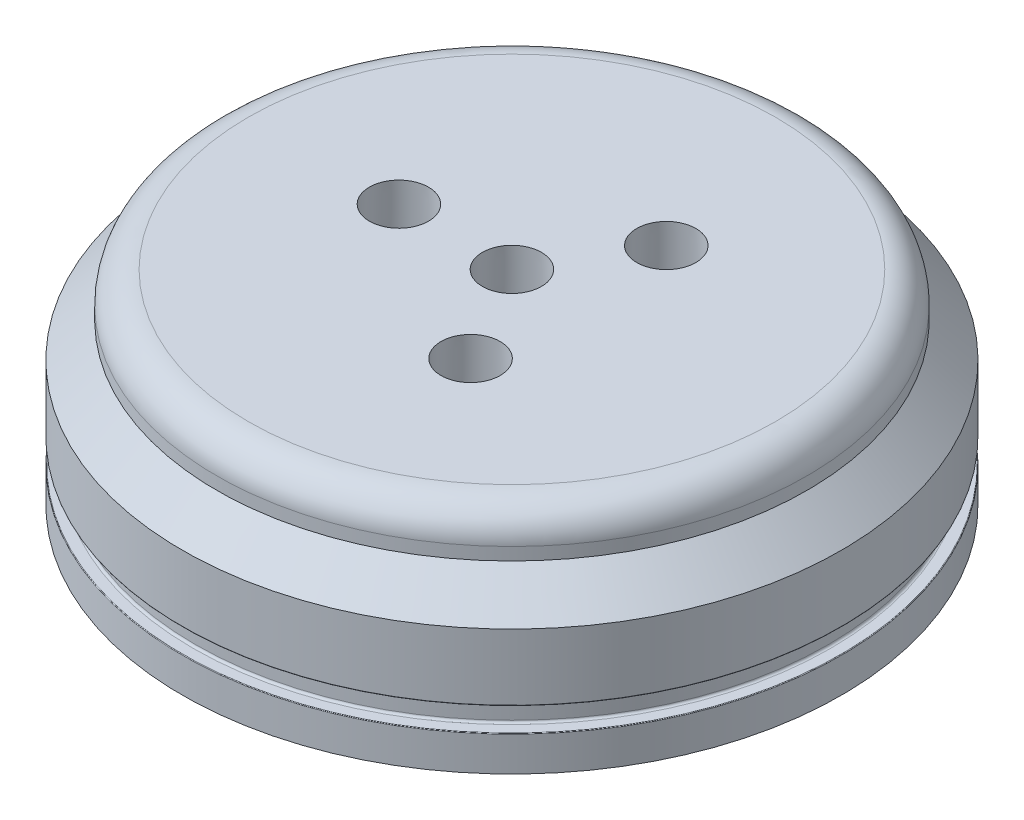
ISO-10303-21;
HEADER;
FILE_DESCRIPTION(('STEP AP214'),'2;1');
FILE_NAME('part.step','',(''),(''),'','','');
FILE_SCHEMA(('AUTOMOTIVE_DESIGN { 1 0 10303 214 1 1 1 1 }'));
ENDSEC;
DATA;
#1=APPLICATION_CONTEXT('core data for automotive mechanical design processes');
#2=APPLICATION_PROTOCOL_DEFINITION('international standard','automotive_design',2000,#1);
#3=PRODUCT_CONTEXT('',#1,'mechanical');
#4=PRODUCT('Part','Part','',(#3));
#5=PRODUCT_RELATED_PRODUCT_CATEGORY('part','',(#4));
#6=PRODUCT_DEFINITION_FORMATION('','',#4);
#7=PRODUCT_DEFINITION_CONTEXT('part definition',#1,'design');
#8=PRODUCT_DEFINITION('design','',#6,#7);
#9=PRODUCT_DEFINITION_SHAPE('','',#8);
#10=(LENGTH_UNIT() NAMED_UNIT(*) SI_UNIT(.MILLI.,.METRE.));
#11=(NAMED_UNIT(*) PLANE_ANGLE_UNIT() SI_UNIT($,.RADIAN.));
#12=(NAMED_UNIT(*) SI_UNIT($,.STERADIAN.) SOLID_ANGLE_UNIT());
#13=UNCERTAINTY_MEASURE_WITH_UNIT(LENGTH_MEASURE(1.E-05),#10,'distance_accuracy_value','');
#14=(GEOMETRIC_REPRESENTATION_CONTEXT(3) GLOBAL_UNCERTAINTY_ASSIGNED_CONTEXT((#13)) GLOBAL_UNIT_ASSIGNED_CONTEXT((#10,
#11,#12)) REPRESENTATION_CONTEXT('',''));
#15=CARTESIAN_POINT('',(0.,0.,0.));
#16=DIRECTION('',(0.,0.,1.));
#17=DIRECTION('',(1.,0.,0.));
#18=AXIS2_PLACEMENT_3D('',#15,#16,#17);
#19=CARTESIAN_POINT('',(-59.69,41.275,0.));
#20=DIRECTION('',(0.,-1.,0.));
#21=DIRECTION('',(0.,0.,-1.));
#22=AXIS2_PLACEMENT_3D('',#19,#20,#21);
#23=PLANE('',#22);
#24=CARTESIAN_POINT('',(0.,41.275,0.));
#25=DIRECTION('',(0.,-1.,0.));
#26=DIRECTION('',(0.,0.,-1.));
#27=AXIS2_PLACEMENT_3D('',#24,#25,#26);
#28=CIRCLE('',#27,5.97790349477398);
#29=CARTESIAN_POINT('',(0.,41.275,-5.97790349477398));
#30=VERTEX_POINT('',#29);
#31=EDGE_CURVE('E94',#30,#30,#28,.T.);
#32=ORIENTED_EDGE('',*,*,#31,.T.);
#33=EDGE_LOOP('',(#32));
#34=FACE_BOUND('',#33,.T.);
#35=CARTESIAN_POINT('',(0.,41.275,0.));
#36=DIRECTION('',(0.,-1.,0.));
#37=DIRECTION('',(0.,0.,-1.));
#38=AXIS2_PLACEMENT_3D('',#35,#36,#37);
#39=CIRCLE('',#38,53.34);
#40=CARTESIAN_POINT('',(0.,41.275,-53.34));
#41=VERTEX_POINT('',#40);
#42=EDGE_CURVE('E11',#41,#41,#39,.F.);
#43=ORIENTED_EDGE('',*,*,#42,.T.);
#44=EDGE_LOOP('',(#43));
#45=FACE_BOUND('',#44,.T.);
#46=CARTESIAN_POINT('',(11.4299999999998,41.275,19.7973407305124));
#47=DIRECTION('',(0.,-1.,0.));
#48=DIRECTION('',(0.,0.,-1.));
#49=AXIS2_PLACEMENT_3D('',#46,#47,#48);
#50=CIRCLE('',#49,5.97790349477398);
#51=CARTESIAN_POINT('',(11.4299999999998,41.275,13.8194372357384));
#52=VERTEX_POINT('',#51);
#53=EDGE_CURVE('E151',#52,#52,#50,.T.);
#54=ORIENTED_EDGE('',*,*,#53,.T.);
#55=EDGE_LOOP('',(#54));
#56=FACE_BOUND('',#55,.T.);
#57=CARTESIAN_POINT('',(11.4300000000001,41.275,-19.7973407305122));
#58=DIRECTION('',(0.,-1.,0.));
#59=DIRECTION('',(0.,0.,-1.));
#60=AXIS2_PLACEMENT_3D('',#57,#58,#59);
#61=CIRCLE('',#60,5.97790349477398);
#62=CARTESIAN_POINT('',(11.4300000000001,41.275,-25.7752442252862));
#63=VERTEX_POINT('',#62);
#64=EDGE_CURVE('E155',#63,#63,#61,.T.);
#65=ORIENTED_EDGE('',*,*,#64,.T.);
#66=EDGE_LOOP('',(#65));
#67=FACE_BOUND('',#66,.T.);
#68=CARTESIAN_POINT('',(-22.86,41.275,0.));
#69=DIRECTION('',(0.,-1.,0.));
#70=DIRECTION('',(0.,0.,-1.));
#71=AXIS2_PLACEMENT_3D('',#68,#69,#70);
#72=CIRCLE('',#71,5.97790349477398);
#73=CARTESIAN_POINT('',(-22.86,41.275,-5.97790349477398));
#74=VERTEX_POINT('',#73);
#75=EDGE_CURVE('E159',#74,#74,#72,.T.);
#76=ORIENTED_EDGE('',*,*,#75,.T.);
#77=EDGE_LOOP('',(#76));
#78=FACE_BOUND('',#77,.T.);
#79=ADVANCED_FACE('F38',(#34,#45,#56,#67,#78),#23,.F.);
#80=CARTESIAN_POINT('',(-50.8,0.,0.));
#81=DIRECTION('',(0.,1.,0.));
#82=DIRECTION('',(0.,0.,1.));
#83=AXIS2_PLACEMENT_3D('',#80,#81,#82);
#84=PLANE('',#83);
#85=CARTESIAN_POINT('',(-26.9694561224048,0.,52.1799036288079));
#86=DIRECTION('',(0.,-1.,0.));
#87=DIRECTION('',(0.,0.,-1.));
#88=AXIS2_PLACEMENT_3D('',#85,#86,#87);
#89=CIRCLE('',#88,1.72719999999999);
#90=CARTESIAN_POINT('',(-26.9694561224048,0.,50.4527036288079));
#91=VERTEX_POINT('',#90);
#92=EDGE_CURVE('E88',#91,#91,#89,.T.);
#93=ORIENTED_EDGE('',*,*,#92,.F.);
#94=EDGE_LOOP('',(#93));
#95=FACE_BOUND('',#94,.T.);
#96=CARTESIAN_POINT('',(-8.85182948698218,0.,58.0666773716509));
#97=DIRECTION('',(0.,-1.,0.));
#98=DIRECTION('',(0.,0.,-1.));
#99=AXIS2_PLACEMENT_3D('',#96,#97,#98);
#100=CIRCLE('',#99,1.72719999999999);
#101=CARTESIAN_POINT('',(-8.85182948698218,0.,56.3394773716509));
#102=VERTEX_POINT('',#101);
#103=EDGE_CURVE('E87',#102,#102,#100,.T.);
#104=ORIENTED_EDGE('',*,*,#103,.F.);
#105=EDGE_LOOP('',(#104));
#106=FACE_BOUND('',#105,.T.);
#107=CARTESIAN_POINT('',(41.2920170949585,0.,41.7739539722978));
#108=DIRECTION('',(0.,-1.,0.));
#109=DIRECTION('',(0.,0.,-1.));
#110=AXIS2_PLACEMENT_3D('',#107,#108,#109);
#111=CIRCLE('',#110,1.72719999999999);
#112=CARTESIAN_POINT('',(41.2920170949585,0.,40.0467539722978));
#113=VERTEX_POINT('',#112);
#114=EDGE_CURVE('E100',#113,#113,#111,.T.);
#115=ORIENTED_EDGE('',*,*,#114,.F.);
#116=EDGE_LOOP('',(#115));
#117=FACE_BOUND('',#116,.T.);
#118=CARTESIAN_POINT('',(52.4893261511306,0.,-26.3621802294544));
#119=DIRECTION('',(0.,-1.,0.));
#120=DIRECTION('',(0.,0.,-1.));
#121=AXIS2_PLACEMENT_3D('',#118,#119,#120);
#122=CIRCLE('',#121,1.72719999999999);
#123=CARTESIAN_POINT('',(52.4893261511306,0.,-28.0893802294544));
#124=VERTEX_POINT('',#123);
#125=EDGE_CURVE('E112',#124,#124,#122,.T.);
#126=ORIENTED_EDGE('',*,*,#125,.F.);
#127=EDGE_LOOP('',(#126));
#128=FACE_BOUND('',#127,.T.);
#129=CARTESIAN_POINT('',(41.2920170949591,0.,-41.7739539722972));
#130=DIRECTION('',(0.,-1.,0.));
#131=DIRECTION('',(0.,0.,-1.));
#132=AXIS2_PLACEMENT_3D('',#129,#130,#131);
#133=CIRCLE('',#132,1.72719999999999);
#134=CARTESIAN_POINT('',(41.2920170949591,0.,-43.5011539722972));
#135=VERTEX_POINT('',#134);
#136=EDGE_CURVE('E118',#135,#135,#133,.T.);
#137=ORIENTED_EDGE('',*,*,#136,.F.);
#138=EDGE_LOOP('',(#137));
#139=FACE_BOUND('',#138,.T.);
#140=CARTESIAN_POINT('',(-8.85182948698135,0.,-58.066677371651));
#141=DIRECTION('',(0.,-1.,0.));
#142=DIRECTION('',(0.,0.,-1.));
#143=AXIS2_PLACEMENT_3D('',#140,#141,#142);
#144=CIRCLE('',#143,1.72719999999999);
#145=CARTESIAN_POINT('',(-8.85182948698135,0.,-59.793877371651));
#146=VERTEX_POINT('',#145);
#147=EDGE_CURVE('E124',#146,#146,#144,.T.);
#148=ORIENTED_EDGE('',*,*,#147,.F.);
#149=EDGE_LOOP('',(#148));
#150=FACE_BOUND('',#149,.T.);
#151=CARTESIAN_POINT('',(-26.9694561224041,0.,-52.1799036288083));
#152=DIRECTION('',(0.,-1.,0.));
#153=DIRECTION('',(0.,0.,-1.));
#154=AXIS2_PLACEMENT_3D('',#151,#152,#153);
#155=CIRCLE('',#154,1.72719999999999);
#156=CARTESIAN_POINT('',(-26.9694561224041,0.,-53.9071036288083));
#157=VERTEX_POINT('',#156);
#158=EDGE_CURVE('E130',#157,#157,#155,.T.);
#159=ORIENTED_EDGE('',*,*,#158,.F.);
#160=EDGE_LOOP('',(#159));
#161=FACE_BOUND('',#160,.T.);
#162=CARTESIAN_POINT('',(-57.9600576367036,0.,-9.525));
#163=DIRECTION('',(0.,-1.,0.));
#164=DIRECTION('',(0.,0.,-1.));
#165=AXIS2_PLACEMENT_3D('',#162,#163,#164);
#166=CIRCLE('',#165,1.72719999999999);
#167=CARTESIAN_POINT('',(-57.9600576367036,0.,-11.2522));
#168=VERTEX_POINT('',#167);
#169=EDGE_CURVE('E136',#168,#168,#166,.T.);
#170=ORIENTED_EDGE('',*,*,#169,.F.);
#171=EDGE_LOOP('',(#170));
#172=FACE_BOUND('',#171,.T.);
#173=CARTESIAN_POINT('',(-57.9600576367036,0.,9.525));
#174=DIRECTION('',(0.,-1.,0.));
#175=DIRECTION('',(0.,0.,-1.));
#176=AXIS2_PLACEMENT_3D('',#173,#174,#175);
#177=CIRCLE('',#176,1.72719999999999);
#178=CARTESIAN_POINT('',(-57.9600576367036,0.,7.79780000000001));
#179=VERTEX_POINT('',#178);
#180=EDGE_CURVE('E142',#179,#179,#177,.T.);
#181=ORIENTED_EDGE('',*,*,#180,.F.);
#182=EDGE_LOOP('',(#181));
#183=FACE_BOUND('',#182,.T.);
#184=CARTESIAN_POINT('',(0.,0.,0.));
#185=DIRECTION('',(0.,-1.,0.));
#186=DIRECTION('',(0.,0.,-1.));
#187=AXIS2_PLACEMENT_3D('',#184,#185,#186);
#188=CIRCLE('',#187,50.8);
#189=CARTESIAN_POINT('',(0.,0.,-50.8));
#190=VERTEX_POINT('',#189);
#191=EDGE_CURVE('E172',#190,#190,#188,.T.);
#192=ORIENTED_EDGE('',*,*,#191,.F.);
#193=EDGE_LOOP('',(#192));
#194=FACE_BOUND('',#193,.T.);
#195=CARTESIAN_POINT('',(0.,0.,0.));
#196=DIRECTION('',(0.,-1.,0.));
#197=DIRECTION('',(0.,0.,-1.));
#198=AXIS2_PLACEMENT_3D('',#195,#196,#197);
#199=CIRCLE('',#198,66.675);
#200=CARTESIAN_POINT('',(0.,0.,-66.675));
#201=VERTEX_POINT('',#200);
#202=EDGE_CURVE('E169',#201,#201,#199,.T.);
#203=ORIENTED_EDGE('',*,*,#202,.T.);
#204=EDGE_LOOP('',(#203));
#205=FACE_BOUND('',#204,.T.);
#206=CARTESIAN_POINT('',(52.4893261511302,0.,26.3621802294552));
#207=DIRECTION('',(0.,-1.,0.));
#208=DIRECTION('',(0.,0.,-1.));
#209=AXIS2_PLACEMENT_3D('',#206,#207,#208);
#210=CIRCLE('',#209,1.72719999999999);
#211=CARTESIAN_POINT('',(52.4893261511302,0.,24.6349802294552));
#212=VERTEX_POINT('',#211);
#213=EDGE_CURVE('E106',#212,#212,#210,.T.);
#214=ORIENTED_EDGE('',*,*,#213,.F.);
#215=EDGE_LOOP('',(#214));
#216=FACE_BOUND('',#215,.T.);
#217=ADVANCED_FACE('F228',(#95,#106,#117,#128,#139,#150,#161,#172,#183,#194,#205,#216),#84,.F.);
#218=CARTESIAN_POINT('',(0.,7.5565,0.));
#219=DIRECTION('',(0.,-1.,0.));
#220=DIRECTION('',(0.,0.,-1.));
#221=AXIS2_PLACEMENT_3D('',#218,#219,#220);
#222=TOROIDAL_SURFACE('',#221,64.4779,0.4445);
#223=CARTESIAN_POINT('',(0.,7.112,0.));
#224=DIRECTION('',(0.,-1.,0.));
#225=DIRECTION('',(0.,0.,-1.));
#226=AXIS2_PLACEMENT_3D('',#223,#224,#225);
#227=CIRCLE('',#226,64.4779);
#228=CARTESIAN_POINT('',(0.,7.112,-64.4779));
#229=VERTEX_POINT('',#228);
#230=EDGE_CURVE('E160',#229,#229,#227,.T.);
#231=ORIENTED_EDGE('',*,*,#230,.F.);
#232=EDGE_LOOP('',(#231));
#233=FACE_BOUND('',#232,.T.);
#234=CARTESIAN_POINT('',(0.,7.5565,0.));
#235=DIRECTION('',(0.,-1.,0.));
#236=DIRECTION('',(0.,0.,-1.));
#237=AXIS2_PLACEMENT_3D('',#234,#235,#236);
#238=CIRCLE('',#237,64.0334);
#239=CARTESIAN_POINT('',(0.,7.5565,-64.0334));
#240=VERTEX_POINT('',#239);
#241=EDGE_CURVE('E199',#240,#240,#238,.T.);
#242=ORIENTED_EDGE('',*,*,#241,.T.);
#243=EDGE_LOOP('',(#242));
#244=FACE_BOUND('',#243,.T.);
#245=ADVANCED_FACE('F234',(#233,#244),#222,.F.);
#246=CARTESIAN_POINT('',(0.,0.,0.));
#247=DIRECTION('',(0.,-1.,0.));
#248=DIRECTION('',(0.,0.,-1.));
#249=AXIS2_PLACEMENT_3D('',#246,#247,#248);
#250=CYLINDRICAL_SURFACE('',#249,64.0334);
#251=ORIENTED_EDGE('',*,*,#241,.F.);
#252=EDGE_LOOP('',(#251));
#253=FACE_BOUND('',#252,.T.);
#254=CARTESIAN_POINT('',(0.,11.4935,0.));
#255=DIRECTION('',(0.,-1.,0.));
#256=DIRECTION('',(0.,0.,-1.));
#257=AXIS2_PLACEMENT_3D('',#254,#255,#256);
#258=CIRCLE('',#257,64.0334);
#259=CARTESIAN_POINT('',(0.,11.4935,-64.0334));
#260=VERTEX_POINT('',#259);
#261=EDGE_CURVE('E196',#260,#260,#258,.T.);
#262=ORIENTED_EDGE('',*,*,#261,.T.);
#263=EDGE_LOOP('',(#262));
#264=FACE_BOUND('',#263,.T.);
#265=ADVANCED_FACE('F264',(#253,#264),#250,.T.);
#266=CARTESIAN_POINT('',(0.,11.4935,0.));
#267=DIRECTION('',(0.,-1.,0.));
#268=DIRECTION('',(0.,0.,-1.));
#269=AXIS2_PLACEMENT_3D('',#266,#267,#268);
#270=TOROIDAL_SURFACE('',#269,64.4779,0.4445);
#271=ORIENTED_EDGE('',*,*,#261,.F.);
#272=EDGE_LOOP('',(#271));
#273=FACE_BOUND('',#272,.T.);
#274=CARTESIAN_POINT('',(0.,11.938,0.));
#275=DIRECTION('',(0.,-1.,0.));
#276=DIRECTION('',(0.,0.,-1.));
#277=AXIS2_PLACEMENT_3D('',#274,#275,#276);
#278=CIRCLE('',#277,64.4779);
#279=CARTESIAN_POINT('',(0.,11.938,-64.4779));
#280=VERTEX_POINT('',#279);
#281=EDGE_CURVE('E193',#280,#280,#278,.T.);
#282=ORIENTED_EDGE('',*,*,#281,.T.);
#283=EDGE_LOOP('',(#282));
#284=FACE_BOUND('',#283,.T.);
#285=ADVANCED_FACE('F260',(#273,#284),#270,.F.);
#286=CARTESIAN_POINT('',(-66.548,11.938,0.));
#287=DIRECTION('',(0.,1.,0.));
#288=DIRECTION('',(0.,0.,1.));
#289=AXIS2_PLACEMENT_3D('',#286,#287,#288);
#290=PLANE('',#289);
#291=ORIENTED_EDGE('',*,*,#281,.F.);
#292=EDGE_LOOP('',(#291));
#293=FACE_BOUND('',#292,.T.);
#294=CARTESIAN_POINT('',(0.,11.938,0.));
#295=DIRECTION('',(0.,-1.,0.));
#296=DIRECTION('',(0.,0.,-1.));
#297=AXIS2_PLACEMENT_3D('',#294,#295,#296);
#298=CIRCLE('',#297,66.548);
#299=CARTESIAN_POINT('',(0.,11.938,-66.548));
#300=VERTEX_POINT('',#299);
#301=EDGE_CURVE('E190',#300,#300,#298,.T.);
#302=ORIENTED_EDGE('',*,*,#301,.T.);
#303=EDGE_LOOP('',(#302));
#304=FACE_BOUND('',#303,.T.);
#305=ADVANCED_FACE('F256',(#293,#304),#290,.F.);
#306=CARTESIAN_POINT('',(0.,12.065,0.));
#307=DIRECTION('',(0.,-1.,0.));
#308=DIRECTION('',(0.,0.,-1.));
#309=AXIS2_PLACEMENT_3D('',#306,#307,#308);
#310=TOROIDAL_SURFACE('',#309,66.548,0.127000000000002);
#311=ORIENTED_EDGE('',*,*,#301,.F.);
#312=EDGE_LOOP('',(#311));
#313=FACE_BOUND('',#312,.T.);
#314=CARTESIAN_POINT('',(0.,12.065,0.));
#315=DIRECTION('',(0.,-1.,0.));
#316=DIRECTION('',(0.,0.,-1.));
#317=AXIS2_PLACEMENT_3D('',#314,#315,#316);
#318=CIRCLE('',#317,66.675);
#319=CARTESIAN_POINT('',(0.,12.065,-66.675));
#320=VERTEX_POINT('',#319);
#321=EDGE_CURVE('E187',#320,#320,#318,.T.);
#322=ORIENTED_EDGE('',*,*,#321,.T.);
#323=EDGE_LOOP('',(#322));
#324=FACE_BOUND('',#323,.T.);
#325=ADVANCED_FACE('F252',(#313,#324),#310,.T.);
#326=CARTESIAN_POINT('',(0.,0.,0.));
#327=DIRECTION('',(0.,-1.,0.));
#328=DIRECTION('',(0.,0.,-1.));
#329=AXIS2_PLACEMENT_3D('',#326,#327,#328);
#330=CYLINDRICAL_SURFACE('',#329,66.675);
#331=ORIENTED_EDGE('',*,*,#321,.F.);
#332=EDGE_LOOP('',(#331));
#333=FACE_BOUND('',#332,.T.);
#334=CARTESIAN_POINT('',(0.,25.4,0.));
#335=DIRECTION('',(0.,-1.,0.));
#336=DIRECTION('',(0.,0.,-1.));
#337=AXIS2_PLACEMENT_3D('',#334,#335,#336);
#338=CIRCLE('',#337,66.675);
#339=CARTESIAN_POINT('',(0.,25.4,-66.675));
#340=VERTEX_POINT('',#339);
#341=EDGE_CURVE('E184',#340,#340,#338,.T.);
#342=ORIENTED_EDGE('',*,*,#341,.T.);
#343=EDGE_LOOP('',(#342));
#344=FACE_BOUND('',#343,.T.);
#345=ADVANCED_FACE('F248',(#333,#344),#330,.T.);
#346=CARTESIAN_POINT('',(0.,32.385,0.));
#347=DIRECTION('',(0.,-1.,0.));
#348=DIRECTION('',(0.,0.,-1.));
#349=AXIS2_PLACEMENT_3D('',#346,#347,#348);
#350=CONICAL_SURFACE('',#349,59.69,0.78539816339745);
#351=ORIENTED_EDGE('',*,*,#341,.F.);
#352=EDGE_LOOP('',(#351));
#353=FACE_BOUND('',#352,.T.);
#354=CARTESIAN_POINT('',(0.,32.385,0.));
#355=DIRECTION('',(0.,-1.,0.));
#356=DIRECTION('',(0.,0.,-1.));
#357=AXIS2_PLACEMENT_3D('',#354,#355,#356);
#358=CIRCLE('',#357,59.69);
#359=CARTESIAN_POINT('',(0.,32.385,-59.69));
#360=VERTEX_POINT('',#359);
#361=EDGE_CURVE('E181',#360,#360,#358,.T.);
#362=ORIENTED_EDGE('',*,*,#361,.T.);
#363=EDGE_LOOP('',(#362));
#364=FACE_BOUND('',#363,.T.);
#365=ADVANCED_FACE('F245',(#353,#364),#350,.T.);
#366=CARTESIAN_POINT('',(0.,0.,0.));
#367=DIRECTION('',(0.,-1.,0.));
#368=DIRECTION('',(0.,0.,-1.));
#369=AXIS2_PLACEMENT_3D('',#366,#367,#368);
#370=CYLINDRICAL_SURFACE('',#369,59.69);
#371=CARTESIAN_POINT('',(0.,34.925,0.));
#372=DIRECTION('',(0.,-1.,0.));
#373=DIRECTION('',(0.,0.,-1.));
#374=AXIS2_PLACEMENT_3D('',#371,#372,#373);
#375=CIRCLE('',#374,59.69);
#376=CARTESIAN_POINT('',(0.,34.925,-59.69));
#377=VERTEX_POINT('',#376);
#378=EDGE_CURVE('E46',#377,#377,#375,.T.);
#379=ORIENTED_EDGE('',*,*,#378,.T.);
#380=EDGE_LOOP('',(#379));
#381=FACE_BOUND('',#380,.T.);
#382=ORIENTED_EDGE('',*,*,#361,.F.);
#383=EDGE_LOOP('',(#382));
#384=FACE_BOUND('',#383,.T.);
#385=ADVANCED_FACE('F210',(#381,#384),#370,.T.);
#386=CARTESIAN_POINT('',(-42.2531067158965,32.385,0.));
#387=DIRECTION('',(0.,1.,0.));
#388=DIRECTION('',(0.,0.,1.));
#389=AXIS2_PLACEMENT_3D('',#386,#387,#388);
#390=PLANE('',#389);
#391=CARTESIAN_POINT('',(0.,32.385,0.));
#392=DIRECTION('',(0.,-1.,0.));
#393=DIRECTION('',(0.,0.,-1.));
#394=AXIS2_PLACEMENT_3D('',#391,#392,#393);
#395=CIRCLE('',#394,6.244082);
#396=CARTESIAN_POINT('',(0.,32.385,-6.244082));
#397=VERTEX_POINT('',#396);
#398=EDGE_CURVE('E728',#397,#397,#395,.T.);
#399=ORIENTED_EDGE('',*,*,#398,.F.);
#400=EDGE_LOOP('',(#399));
#401=FACE_BOUND('',#400,.T.);
#402=CARTESIAN_POINT('',(11.4299999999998,32.385,19.7973407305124));
#403=DIRECTION('',(0.,-1.,0.));
#404=DIRECTION('',(0.,0.,-1.));
#405=AXIS2_PLACEMENT_3D('',#402,#403,#404);
#406=CIRCLE('',#405,6.244082);
#407=CARTESIAN_POINT('',(11.4299999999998,32.385,13.5532587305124));
#408=VERTEX_POINT('',#407);
#409=EDGE_CURVE('E148',#408,#408,#406,.T.);
#410=ORIENTED_EDGE('',*,*,#409,.F.);
#411=EDGE_LOOP('',(#410));
#412=FACE_BOUND('',#411,.T.);
#413=CARTESIAN_POINT('',(11.4300000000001,32.385,-19.7973407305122));
#414=DIRECTION('',(0.,-1.,0.));
#415=DIRECTION('',(0.,0.,-1.));
#416=AXIS2_PLACEMENT_3D('',#413,#414,#415);
#417=CIRCLE('',#416,6.244082);
#418=CARTESIAN_POINT('',(11.4300000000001,32.385,-26.0414227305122));
#419=VERTEX_POINT('',#418);
#420=EDGE_CURVE('E152',#419,#419,#417,.T.);
#421=ORIENTED_EDGE('',*,*,#420,.F.);
#422=EDGE_LOOP('',(#421));
#423=FACE_BOUND('',#422,.T.);
#424=CARTESIAN_POINT('',(-22.86,32.385,0.));
#425=DIRECTION('',(0.,-1.,0.));
#426=DIRECTION('',(0.,0.,-1.));
#427=AXIS2_PLACEMENT_3D('',#424,#425,#426);
#428=CIRCLE('',#427,6.244082);
#429=CARTESIAN_POINT('',(-22.86,32.385,-6.244082));
#430=VERTEX_POINT('',#429);
#431=EDGE_CURVE('E156',#430,#430,#428,.T.);
#432=ORIENTED_EDGE('',*,*,#431,.F.);
#433=EDGE_LOOP('',(#432));
#434=FACE_BOUND('',#433,.T.);
#435=CARTESIAN_POINT('',(0.,32.385,0.));
#436=DIRECTION('',(0.,-1.,0.));
#437=DIRECTION('',(0.,0.,-1.));
#438=AXIS2_PLACEMENT_3D('',#435,#436,#437);
#439=CIRCLE('',#438,42.2531067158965);
#440=CARTESIAN_POINT('',(0.,32.385,-42.2531067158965));
#441=VERTEX_POINT('',#440);
#442=EDGE_CURVE('E178',#441,#441,#439,.T.);
#443=ORIENTED_EDGE('',*,*,#442,.T.);
#444=EDGE_LOOP('',(#443));
#445=FACE_BOUND('',#444,.T.);
#446=ADVANCED_FACE('F241',(#401,#412,#423,#434,#445),#390,.F.);
#447=CARTESIAN_POINT('',(0.,23.8381067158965,0.));
#448=DIRECTION('',(0.,-1.,0.));
#449=DIRECTION('',(0.,0.,-1.));
#450=AXIS2_PLACEMENT_3D('',#447,#448,#449);
#451=TOROIDAL_SURFACE('',#450,42.2531067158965,8.54689328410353);
#452=ORIENTED_EDGE('',*,*,#442,.F.);
#453=EDGE_LOOP('',(#452));
#454=FACE_BOUND('',#453,.T.);
#455=CARTESIAN_POINT('',(0.,23.8381067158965,0.));
#456=DIRECTION('',(0.,-1.,0.));
#457=DIRECTION('',(0.,0.,-1.));
#458=AXIS2_PLACEMENT_3D('',#455,#456,#457);
#459=CIRCLE('',#458,50.8);
#460=CARTESIAN_POINT('',(0.,23.8381067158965,-50.8));
#461=VERTEX_POINT('',#460);
#462=EDGE_CURVE('E175',#461,#461,#459,.T.);
#463=ORIENTED_EDGE('',*,*,#462,.T.);
#464=EDGE_LOOP('',(#463));
#465=FACE_BOUND('',#464,.T.);
#466=ADVANCED_FACE('F311',(#454,#465),#451,.F.);
#467=CARTESIAN_POINT('',(0.,0.,0.));
#468=DIRECTION('',(0.,-1.,0.));
#469=DIRECTION('',(0.,0.,-1.));
#470=AXIS2_PLACEMENT_3D('',#467,#468,#469);
#471=CYLINDRICAL_SURFACE('',#470,50.8);
#472=ORIENTED_EDGE('',*,*,#462,.F.);
#473=EDGE_LOOP('',(#472));
#474=FACE_BOUND('',#473,.T.);
#475=ORIENTED_EDGE('',*,*,#191,.T.);
#476=EDGE_LOOP('',(#475));
#477=FACE_BOUND('',#476,.T.);
#478=ADVANCED_FACE('F307',(#474,#477),#471,.F.);
#479=CARTESIAN_POINT('',(0.,0.,0.));
#480=DIRECTION('',(0.,-1.,0.));
#481=DIRECTION('',(0.,0.,-1.));
#482=AXIS2_PLACEMENT_3D('',#479,#480,#481);
#483=CYLINDRICAL_SURFACE('',#482,66.675);
#484=ORIENTED_EDGE('',*,*,#202,.F.);
#485=EDGE_LOOP('',(#484));
#486=FACE_BOUND('',#485,.T.);
#487=CARTESIAN_POINT('',(0.,6.98499999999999,0.));
#488=DIRECTION('',(0.,-1.,0.));
#489=DIRECTION('',(0.,0.,-1.));
#490=AXIS2_PLACEMENT_3D('',#487,#488,#489);
#491=CIRCLE('',#490,66.675);
#492=CARTESIAN_POINT('',(0.,6.98499999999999,-66.675));
#493=VERTEX_POINT('',#492);
#494=EDGE_CURVE('E166',#493,#493,#491,.T.);
#495=ORIENTED_EDGE('',*,*,#494,.T.);
#496=EDGE_LOOP('',(#495));
#497=FACE_BOUND('',#496,.T.);
#498=ADVANCED_FACE('F300',(#486,#497),#483,.T.);
#499=CARTESIAN_POINT('',(0.,6.98499999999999,0.));
#500=DIRECTION('',(0.,-1.,0.));
#501=DIRECTION('',(0.,0.,-1.));
#502=AXIS2_PLACEMENT_3D('',#499,#500,#501);
#503=TOROIDAL_SURFACE('',#502,66.548,0.127000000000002);
#504=ORIENTED_EDGE('',*,*,#494,.F.);
#505=EDGE_LOOP('',(#504));
#506=FACE_BOUND('',#505,.T.);
#507=CARTESIAN_POINT('',(0.,7.11199999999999,0.));
#508=DIRECTION('',(0.,-1.,0.));
#509=DIRECTION('',(0.,0.,-1.));
#510=AXIS2_PLACEMENT_3D('',#507,#508,#509);
#511=CIRCLE('',#510,66.548);
#512=CARTESIAN_POINT('',(0.,7.11199999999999,-66.548));
#513=VERTEX_POINT('',#512);
#514=EDGE_CURVE('E163',#513,#513,#511,.T.);
#515=ORIENTED_EDGE('',*,*,#514,.T.);
#516=EDGE_LOOP('',(#515));
#517=FACE_BOUND('',#516,.T.);
#518=ADVANCED_FACE('F291',(#506,#517),#503,.T.);
#519=CARTESIAN_POINT('',(-64.4779,7.112,0.));
#520=DIRECTION('',(0.,-1.,0.));
#521=DIRECTION('',(0.,0.,-1.));
#522=AXIS2_PLACEMENT_3D('',#519,#520,#521);
#523=PLANE('',#522);
#524=ORIENTED_EDGE('',*,*,#514,.F.);
#525=EDGE_LOOP('',(#524));
#526=FACE_BOUND('',#525,.T.);
#527=ORIENTED_EDGE('',*,*,#230,.T.);
#528=EDGE_LOOP('',(#527));
#529=FACE_BOUND('',#528,.T.);
#530=ADVANCED_FACE('F288',(#526,#529),#523,.F.);
#531=CARTESIAN_POINT('',(-22.86,32.385,0.));
#532=DIRECTION('',(0.,-1.,0.));
#533=DIRECTION('',(0.,0.,-1.));
#534=AXIS2_PLACEMENT_3D('',#531,#532,#533);
#535=CONICAL_SURFACE('',#534,6.244082,0.0299323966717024);
#536=ORIENTED_EDGE('',*,*,#431,.T.);
#537=EDGE_LOOP('',(#536));
#538=FACE_BOUND('',#537,.T.);
#539=ORIENTED_EDGE('',*,*,#75,.F.);
#540=EDGE_LOOP('',(#539));
#541=FACE_BOUND('',#540,.T.);
#542=ADVANCED_FACE('F290',(#538,#541),#535,.F.);
#543=CARTESIAN_POINT('',(11.4300000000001,32.385,-19.7973407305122));
#544=DIRECTION('',(0.,-1.,0.));
#545=DIRECTION('',(0.,0.,-1.));
#546=AXIS2_PLACEMENT_3D('',#543,#544,#545);
#547=CONICAL_SURFACE('',#546,6.244082,0.0299323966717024);
#548=ORIENTED_EDGE('',*,*,#420,.T.);
#549=EDGE_LOOP('',(#548));
#550=FACE_BOUND('',#549,.T.);
#551=ORIENTED_EDGE('',*,*,#64,.F.);
#552=EDGE_LOOP('',(#551));
#553=FACE_BOUND('',#552,.T.);
#554=ADVANCED_FACE('F223',(#550,#553),#547,.F.);
#555=CARTESIAN_POINT('',(11.4299999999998,32.385,19.7973407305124));
#556=DIRECTION('',(0.,-1.,0.));
#557=DIRECTION('',(0.,0.,-1.));
#558=AXIS2_PLACEMENT_3D('',#555,#556,#557);
#559=CONICAL_SURFACE('',#558,6.244082,0.0299323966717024);
#560=ORIENTED_EDGE('',*,*,#409,.T.);
#561=EDGE_LOOP('',(#560));
#562=FACE_BOUND('',#561,.T.);
#563=ORIENTED_EDGE('',*,*,#53,.F.);
#564=EDGE_LOOP('',(#563));
#565=FACE_BOUND('',#564,.T.);
#566=ADVANCED_FACE('F215',(#562,#565),#559,.F.);
#567=CARTESIAN_POINT('',(0.,34.925,0.));
#568=DIRECTION('',(0.,-1.,0.));
#569=DIRECTION('',(0.,0.,-1.));
#570=AXIS2_PLACEMENT_3D('',#567,#568,#569);
#571=TOROIDAL_SURFACE('',#570,53.34,6.35);
#572=ORIENTED_EDGE('',*,*,#42,.F.);
#573=EDGE_LOOP('',(#572));
#574=FACE_BOUND('',#573,.T.);
#575=ORIENTED_EDGE('',*,*,#378,.F.);
#576=EDGE_LOOP('',(#575));
#577=FACE_BOUND('',#576,.T.);
#578=ADVANCED_FACE('F40',(#574,#577),#571,.T.);
#579=CARTESIAN_POINT('',(-57.9600576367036,12.2936,9.525));
#580=DIRECTION('',(0.,-1.,0.));
#581=DIRECTION('',(0.,0.,-1.));
#582=AXIS2_PLACEMENT_3D('',#579,#580,#581);
#583=CONICAL_SURFACE('',#582,1.7272,1.02974425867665);
#584=CARTESIAN_POINT('',(-57.9600576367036,13.3314064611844,9.525));
#585=VERTEX_POINT('',#584);
#586=VERTEX_LOOP('',#585);
#587=FACE_BOUND('',#586,.T.);
#588=CARTESIAN_POINT('',(-57.9600576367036,12.2936,9.525));
#589=DIRECTION('',(0.,-1.,0.));
#590=DIRECTION('',(0.,0.,-1.));
#591=AXIS2_PLACEMENT_3D('',#588,#589,#590);
#592=CIRCLE('',#591,1.7272);
#593=CARTESIAN_POINT('',(-57.9600576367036,12.2936,7.7978));
#594=VERTEX_POINT('',#593);
#595=EDGE_CURVE('E145',#594,#594,#592,.T.);
#596=ORIENTED_EDGE('',*,*,#595,.T.);
#597=EDGE_LOOP('',(#596));
#598=FACE_BOUND('',#597,.T.);
#599=ADVANCED_FACE('F214',(#587,#598),#583,.F.);
#600=CARTESIAN_POINT('',(-57.9600576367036,0.,9.525));
#601=DIRECTION('',(0.,-1.,0.));
#602=DIRECTION('',(0.,0.,-1.));
#603=AXIS2_PLACEMENT_3D('',#600,#601,#602);
#604=CYLINDRICAL_SURFACE('',#603,1.72719999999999);
#605=ORIENTED_EDGE('',*,*,#595,.F.);
#606=EDGE_LOOP('',(#605));
#607=FACE_BOUND('',#606,.T.);
#608=ORIENTED_EDGE('',*,*,#180,.T.);
#609=EDGE_LOOP('',(#608));
#610=FACE_BOUND('',#609,.T.);
#611=ADVANCED_FACE('F221',(#607,#610),#604,.F.);
#612=CARTESIAN_POINT('',(-57.9600576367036,12.2936,-9.525));
#613=DIRECTION('',(0.,-1.,0.));
#614=DIRECTION('',(0.,0.,-1.));
#615=AXIS2_PLACEMENT_3D('',#612,#613,#614);
#616=CONICAL_SURFACE('',#615,1.7272,1.02974425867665);
#617=CARTESIAN_POINT('',(-57.9600576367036,13.3314064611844,-9.525));
#618=VERTEX_POINT('',#617);
#619=VERTEX_LOOP('',#618);
#620=FACE_BOUND('',#619,.T.);
#621=CARTESIAN_POINT('',(-57.9600576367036,12.2936,-9.525));
#622=DIRECTION('',(0.,-1.,0.));
#623=DIRECTION('',(0.,0.,-1.));
#624=AXIS2_PLACEMENT_3D('',#621,#622,#623);
#625=CIRCLE('',#624,1.7272);
#626=CARTESIAN_POINT('',(-57.9600576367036,12.2936,-11.2522));
#627=VERTEX_POINT('',#626);
#628=EDGE_CURVE('E139',#627,#627,#625,.T.);
#629=ORIENTED_EDGE('',*,*,#628,.T.);
#630=EDGE_LOOP('',(#629));
#631=FACE_BOUND('',#630,.T.);
#632=ADVANCED_FACE('F383',(#620,#631),#616,.F.);
#633=CARTESIAN_POINT('',(-57.9600576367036,0.,-9.525));
#634=DIRECTION('',(0.,-1.,0.));
#635=DIRECTION('',(0.,0.,-1.));
#636=AXIS2_PLACEMENT_3D('',#633,#634,#635);
#637=CYLINDRICAL_SURFACE('',#636,1.72719999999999);
#638=ORIENTED_EDGE('',*,*,#628,.F.);
#639=EDGE_LOOP('',(#638));
#640=FACE_BOUND('',#639,.T.);
#641=ORIENTED_EDGE('',*,*,#169,.T.);
#642=EDGE_LOOP('',(#641));
#643=FACE_BOUND('',#642,.T.);
#644=ADVANCED_FACE('F379',(#640,#643),#637,.F.);
#645=CARTESIAN_POINT('',(-26.9694561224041,12.2936,-52.1799036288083));
#646=DIRECTION('',(0.,-1.,0.));
#647=DIRECTION('',(0.,0.,-1.));
#648=AXIS2_PLACEMENT_3D('',#645,#646,#647);
#649=CONICAL_SURFACE('',#648,1.7272,1.02974425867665);
#650=CARTESIAN_POINT('',(-26.9694561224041,13.3314064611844,-52.1799036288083));
#651=VERTEX_POINT('',#650);
#652=VERTEX_LOOP('',#651);
#653=FACE_BOUND('',#652,.T.);
#654=CARTESIAN_POINT('',(-26.9694561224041,12.2936,-52.1799036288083));
#655=DIRECTION('',(0.,-1.,0.));
#656=DIRECTION('',(0.,0.,-1.));
#657=AXIS2_PLACEMENT_3D('',#654,#655,#656);
#658=CIRCLE('',#657,1.7272);
#659=CARTESIAN_POINT('',(-26.9694561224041,12.2936,-53.9071036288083));
#660=VERTEX_POINT('',#659);
#661=EDGE_CURVE('E133',#660,#660,#658,.T.);
#662=ORIENTED_EDGE('',*,*,#661,.T.);
#663=EDGE_LOOP('',(#662));
#664=FACE_BOUND('',#663,.T.);
#665=ADVANCED_FACE('F375',(#653,#664),#649,.F.);
#666=CARTESIAN_POINT('',(-26.9694561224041,0.,-52.1799036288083));
#667=DIRECTION('',(0.,-1.,0.));
#668=DIRECTION('',(0.,0.,-1.));
#669=AXIS2_PLACEMENT_3D('',#666,#667,#668);
#670=CYLINDRICAL_SURFACE('',#669,1.72719999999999);
#671=ORIENTED_EDGE('',*,*,#661,.F.);
#672=EDGE_LOOP('',(#671));
#673=FACE_BOUND('',#672,.T.);
#674=ORIENTED_EDGE('',*,*,#158,.T.);
#675=EDGE_LOOP('',(#674));
#676=FACE_BOUND('',#675,.T.);
#677=ADVANCED_FACE('F371',(#673,#676),#670,.F.);
#678=CARTESIAN_POINT('',(-8.85182948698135,12.2936,-58.066677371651));
#679=DIRECTION('',(0.,-1.,0.));
#680=DIRECTION('',(0.,0.,-1.));
#681=AXIS2_PLACEMENT_3D('',#678,#679,#680);
#682=CONICAL_SURFACE('',#681,1.7272,1.02974425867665);
#683=CARTESIAN_POINT('',(-8.85182948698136,13.3314064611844,-58.066677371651));
#684=VERTEX_POINT('',#683);
#685=VERTEX_LOOP('',#684);
#686=FACE_BOUND('',#685,.T.);
#687=CARTESIAN_POINT('',(-8.85182948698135,12.2936,-58.066677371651));
#688=DIRECTION('',(0.,-1.,0.));
#689=DIRECTION('',(0.,0.,-1.));
#690=AXIS2_PLACEMENT_3D('',#687,#688,#689);
#691=CIRCLE('',#690,1.7272);
#692=CARTESIAN_POINT('',(-8.85182948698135,12.2936,-59.793877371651));
#693=VERTEX_POINT('',#692);
#694=EDGE_CURVE('E127',#693,#693,#691,.T.);
#695=ORIENTED_EDGE('',*,*,#694,.T.);
#696=EDGE_LOOP('',(#695));
#697=FACE_BOUND('',#696,.T.);
#698=ADVANCED_FACE('F367',(#686,#697),#682,.F.);
#699=CARTESIAN_POINT('',(-8.85182948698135,0.,-58.066677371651));
#700=DIRECTION('',(0.,-1.,0.));
#701=DIRECTION('',(0.,0.,-1.));
#702=AXIS2_PLACEMENT_3D('',#699,#700,#701);
#703=CYLINDRICAL_SURFACE('',#702,1.72719999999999);
#704=ORIENTED_EDGE('',*,*,#694,.F.);
#705=EDGE_LOOP('',(#704));
#706=FACE_BOUND('',#705,.T.);
#707=ORIENTED_EDGE('',*,*,#147,.T.);
#708=EDGE_LOOP('',(#707));
#709=FACE_BOUND('',#708,.T.);
#710=ADVANCED_FACE('F363',(#706,#709),#703,.F.);
#711=CARTESIAN_POINT('',(41.2920170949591,12.2936,-41.7739539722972));
#712=DIRECTION('',(0.,-1.,0.));
#713=DIRECTION('',(0.,0.,-1.));
#714=AXIS2_PLACEMENT_3D('',#711,#712,#713);
#715=CONICAL_SURFACE('',#714,1.7272,1.02974425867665);
#716=CARTESIAN_POINT('',(41.2920170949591,13.3314064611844,-41.7739539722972));
#717=VERTEX_POINT('',#716);
#718=VERTEX_LOOP('',#717);
#719=FACE_BOUND('',#718,.T.);
#720=CARTESIAN_POINT('',(41.2920170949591,12.2936,-41.7739539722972));
#721=DIRECTION('',(0.,-1.,0.));
#722=DIRECTION('',(0.,0.,-1.));
#723=AXIS2_PLACEMENT_3D('',#720,#721,#722);
#724=CIRCLE('',#723,1.7272);
#725=CARTESIAN_POINT('',(41.2920170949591,12.2936,-43.5011539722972));
#726=VERTEX_POINT('',#725);
#727=EDGE_CURVE('E121',#726,#726,#724,.T.);
#728=ORIENTED_EDGE('',*,*,#727,.T.);
#729=EDGE_LOOP('',(#728));
#730=FACE_BOUND('',#729,.T.);
#731=ADVANCED_FACE('F359',(#719,#730),#715,.F.);
#732=CARTESIAN_POINT('',(41.2920170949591,0.,-41.7739539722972));
#733=DIRECTION('',(0.,-1.,0.));
#734=DIRECTION('',(0.,0.,-1.));
#735=AXIS2_PLACEMENT_3D('',#732,#733,#734);
#736=CYLINDRICAL_SURFACE('',#735,1.72719999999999);
#737=ORIENTED_EDGE('',*,*,#727,.F.);
#738=EDGE_LOOP('',(#737));
#739=FACE_BOUND('',#738,.T.);
#740=ORIENTED_EDGE('',*,*,#136,.T.);
#741=EDGE_LOOP('',(#740));
#742=FACE_BOUND('',#741,.T.);
#743=ADVANCED_FACE('F355',(#739,#742),#736,.F.);
#744=CARTESIAN_POINT('',(52.4893261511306,12.2936,-26.3621802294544));
#745=DIRECTION('',(0.,-1.,0.));
#746=DIRECTION('',(0.,0.,-1.));
#747=AXIS2_PLACEMENT_3D('',#744,#745,#746);
#748=CONICAL_SURFACE('',#747,1.7272,1.02974425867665);
#749=CARTESIAN_POINT('',(52.4893261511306,13.3314064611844,-26.3621802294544));
#750=VERTEX_POINT('',#749);
#751=VERTEX_LOOP('',#750);
#752=FACE_BOUND('',#751,.T.);
#753=CARTESIAN_POINT('',(52.4893261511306,12.2936,-26.3621802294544));
#754=DIRECTION('',(0.,-1.,0.));
#755=DIRECTION('',(0.,0.,-1.));
#756=AXIS2_PLACEMENT_3D('',#753,#754,#755);
#757=CIRCLE('',#756,1.7272);
#758=CARTESIAN_POINT('',(52.4893261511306,12.2936,-28.0893802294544));
#759=VERTEX_POINT('',#758);
#760=EDGE_CURVE('E115',#759,#759,#757,.T.);
#761=ORIENTED_EDGE('',*,*,#760,.T.);
#762=EDGE_LOOP('',(#761));
#763=FACE_BOUND('',#762,.T.);
#764=ADVANCED_FACE('F351',(#752,#763),#748,.F.);
#765=CARTESIAN_POINT('',(52.4893261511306,0.,-26.3621802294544));
#766=DIRECTION('',(0.,-1.,0.));
#767=DIRECTION('',(0.,0.,-1.));
#768=AXIS2_PLACEMENT_3D('',#765,#766,#767);
#769=CYLINDRICAL_SURFACE('',#768,1.72719999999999);
#770=ORIENTED_EDGE('',*,*,#760,.F.);
#771=EDGE_LOOP('',(#770));
#772=FACE_BOUND('',#771,.T.);
#773=ORIENTED_EDGE('',*,*,#125,.T.);
#774=EDGE_LOOP('',(#773));
#775=FACE_BOUND('',#774,.T.);
#776=ADVANCED_FACE('F343',(#772,#775),#769,.F.);
#777=CARTESIAN_POINT('',(52.4893261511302,12.2936,26.3621802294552));
#778=DIRECTION('',(0.,-1.,0.));
#779=DIRECTION('',(0.,0.,-1.));
#780=AXIS2_PLACEMENT_3D('',#777,#778,#779);
#781=CONICAL_SURFACE('',#780,1.7272,1.02974425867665);
#782=CARTESIAN_POINT('',(52.4893261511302,13.3314064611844,26.3621802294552));
#783=VERTEX_POINT('',#782);
#784=VERTEX_LOOP('',#783);
#785=FACE_BOUND('',#784,.T.);
#786=CARTESIAN_POINT('',(52.4893261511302,12.2936,26.3621802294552));
#787=DIRECTION('',(0.,-1.,0.));
#788=DIRECTION('',(0.,0.,-1.));
#789=AXIS2_PLACEMENT_3D('',#786,#787,#788);
#790=CIRCLE('',#789,1.7272);
#791=CARTESIAN_POINT('',(52.4893261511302,12.2936,24.6349802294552));
#792=VERTEX_POINT('',#791);
#793=EDGE_CURVE('E109',#792,#792,#790,.T.);
#794=ORIENTED_EDGE('',*,*,#793,.T.);
#795=EDGE_LOOP('',(#794));
#796=FACE_BOUND('',#795,.T.);
#797=ADVANCED_FACE('F333',(#785,#796),#781,.F.);
#798=CARTESIAN_POINT('',(52.4893261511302,0.,26.3621802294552));
#799=DIRECTION('',(0.,-1.,0.));
#800=DIRECTION('',(0.,0.,-1.));
#801=AXIS2_PLACEMENT_3D('',#798,#799,#800);
#802=CYLINDRICAL_SURFACE('',#801,1.72719999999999);
#803=ORIENTED_EDGE('',*,*,#793,.F.);
#804=EDGE_LOOP('',(#803));
#805=FACE_BOUND('',#804,.T.);
#806=ORIENTED_EDGE('',*,*,#213,.T.);
#807=EDGE_LOOP('',(#806));
#808=FACE_BOUND('',#807,.T.);
#809=ADVANCED_FACE('F330',(#805,#808),#802,.F.);
#810=CARTESIAN_POINT('',(41.2920170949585,12.2936,41.7739539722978));
#811=DIRECTION('',(0.,-1.,0.));
#812=DIRECTION('',(0.,0.,-1.));
#813=AXIS2_PLACEMENT_3D('',#810,#811,#812);
#814=CONICAL_SURFACE('',#813,1.7272,1.02974425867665);
#815=CARTESIAN_POINT('',(41.2920170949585,13.3314064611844,41.7739539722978));
#816=VERTEX_POINT('',#815);
#817=VERTEX_LOOP('',#816);
#818=FACE_BOUND('',#817,.T.);
#819=CARTESIAN_POINT('',(41.2920170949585,12.2936,41.7739539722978));
#820=DIRECTION('',(0.,-1.,0.));
#821=DIRECTION('',(0.,0.,-1.));
#822=AXIS2_PLACEMENT_3D('',#819,#820,#821);
#823=CIRCLE('',#822,1.7272);
#824=CARTESIAN_POINT('',(41.2920170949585,12.2936,40.0467539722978));
#825=VERTEX_POINT('',#824);
#826=EDGE_CURVE('E103',#825,#825,#823,.T.);
#827=ORIENTED_EDGE('',*,*,#826,.T.);
#828=EDGE_LOOP('',(#827));
#829=FACE_BOUND('',#828,.T.);
#830=ADVANCED_FACE('F332',(#818,#829),#814,.F.);
#831=CARTESIAN_POINT('',(41.2920170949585,0.,41.7739539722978));
#832=DIRECTION('',(0.,-1.,0.));
#833=DIRECTION('',(0.,0.,-1.));
#834=AXIS2_PLACEMENT_3D('',#831,#832,#833);
#835=CYLINDRICAL_SURFACE('',#834,1.72719999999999);
#836=ORIENTED_EDGE('',*,*,#826,.F.);
#837=EDGE_LOOP('',(#836));
#838=FACE_BOUND('',#837,.T.);
#839=ORIENTED_EDGE('',*,*,#114,.T.);
#840=EDGE_LOOP('',(#839));
#841=FACE_BOUND('',#840,.T.);
#842=ADVANCED_FACE('F340',(#838,#841),#835,.F.);
#843=CARTESIAN_POINT('',(-8.85182948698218,12.2936,58.0666773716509));
#844=DIRECTION('',(0.,-1.,0.));
#845=DIRECTION('',(0.,0.,-1.));
#846=AXIS2_PLACEMENT_3D('',#843,#844,#845);
#847=CONICAL_SURFACE('',#846,1.7272,1.02974425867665);
#848=CARTESIAN_POINT('',(-8.85182948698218,13.3314064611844,58.0666773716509));
#849=VERTEX_POINT('',#848);
#850=VERTEX_LOOP('',#849);
#851=FACE_BOUND('',#850,.T.);
#852=CARTESIAN_POINT('',(-8.85182948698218,12.2936,58.0666773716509));
#853=DIRECTION('',(0.,-1.,0.));
#854=DIRECTION('',(0.,0.,-1.));
#855=AXIS2_PLACEMENT_3D('',#852,#853,#854);
#856=CIRCLE('',#855,1.7272);
#857=CARTESIAN_POINT('',(-8.85182948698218,12.2936,56.3394773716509));
#858=VERTEX_POINT('',#857);
#859=EDGE_CURVE('E91',#858,#858,#856,.T.);
#860=ORIENTED_EDGE('',*,*,#859,.T.);
#861=EDGE_LOOP('',(#860));
#862=FACE_BOUND('',#861,.T.);
#863=ADVANCED_FACE('F461',(#851,#862),#847,.F.);
#864=CARTESIAN_POINT('',(-8.85182948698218,0.,58.0666773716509));
#865=DIRECTION('',(0.,-1.,0.));
#866=DIRECTION('',(0.,0.,-1.));
#867=AXIS2_PLACEMENT_3D('',#864,#865,#866);
#868=CYLINDRICAL_SURFACE('',#867,1.72719999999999);
#869=ORIENTED_EDGE('',*,*,#859,.F.);
#870=EDGE_LOOP('',(#869));
#871=FACE_BOUND('',#870,.T.);
#872=ORIENTED_EDGE('',*,*,#103,.T.);
#873=EDGE_LOOP('',(#872));
#874=FACE_BOUND('',#873,.T.);
#875=ADVANCED_FACE('F81',(#871,#874),#868,.F.);
#876=CARTESIAN_POINT('',(-26.9694561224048,12.2936,52.1799036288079));
#877=DIRECTION('',(0.,-1.,0.));
#878=DIRECTION('',(0.,0.,-1.));
#879=AXIS2_PLACEMENT_3D('',#876,#877,#878);
#880=CONICAL_SURFACE('',#879,1.7272,1.02974425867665);
#881=CARTESIAN_POINT('',(-26.9694561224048,13.3314064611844,52.1799036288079));
#882=VERTEX_POINT('',#881);
#883=VERTEX_LOOP('',#882);
#884=FACE_BOUND('',#883,.T.);
#885=CARTESIAN_POINT('',(-26.9694561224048,12.2936,52.1799036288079));
#886=DIRECTION('',(0.,-1.,0.));
#887=DIRECTION('',(0.,0.,-1.));
#888=AXIS2_PLACEMENT_3D('',#885,#886,#887);
#889=CIRCLE('',#888,1.7272);
#890=CARTESIAN_POINT('',(-26.9694561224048,12.2936,50.4527036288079));
#891=VERTEX_POINT('',#890);
#892=EDGE_CURVE('E85',#891,#891,#889,.T.);
#893=ORIENTED_EDGE('',*,*,#892,.T.);
#894=EDGE_LOOP('',(#893));
#895=FACE_BOUND('',#894,.T.);
#896=ADVANCED_FACE('F77',(#884,#895),#880,.F.);
#897=CARTESIAN_POINT('',(-26.9694561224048,0.,52.1799036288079));
#898=DIRECTION('',(0.,-1.,0.));
#899=DIRECTION('',(0.,0.,-1.));
#900=AXIS2_PLACEMENT_3D('',#897,#898,#899);
#901=CYLINDRICAL_SURFACE('',#900,1.72719999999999);
#902=ORIENTED_EDGE('',*,*,#892,.F.);
#903=EDGE_LOOP('',(#902));
#904=FACE_BOUND('',#903,.T.);
#905=ORIENTED_EDGE('',*,*,#92,.T.);
#906=EDGE_LOOP('',(#905));
#907=FACE_BOUND('',#906,.T.);
#908=ADVANCED_FACE('F80',(#904,#907),#901,.F.);
#909=CARTESIAN_POINT('',(0.,32.385,0.));
#910=DIRECTION('',(0.,-1.,0.));
#911=DIRECTION('',(0.,0.,-1.));
#912=AXIS2_PLACEMENT_3D('',#909,#910,#911);
#913=CONICAL_SURFACE('',#912,6.244082,0.0299323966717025);
#914=ORIENTED_EDGE('',*,*,#398,.T.);
#915=EDGE_LOOP('',(#914));
#916=FACE_BOUND('',#915,.T.);
#917=ORIENTED_EDGE('',*,*,#31,.F.);
#918=EDGE_LOOP('',(#917));
#919=FACE_BOUND('',#918,.T.);
#920=ADVANCED_FACE('F450',(#916,#919),#913,.F.);
#921=CLOSED_SHELL('',(#79,#217,#245,#265,#285,#305,#325,#345,#365,#385,#446,#466,#478,#498,#518,
#530,#542,#554,#566,#578,#599,#611,#632,#644,#665,#677,#698,#710,#731,#743,#764,#776,#797,#809,
#830,#842,#863,#875,#896,#908,#920));
#922=MANIFOLD_SOLID_BREP('B2',#921);
#923=ADVANCED_BREP_SHAPE_REPRESENTATION('',(#18,#922),#14);
#924=SHAPE_DEFINITION_REPRESENTATION(#9,#923);
ENDSEC;
END-ISO-10303-21;
